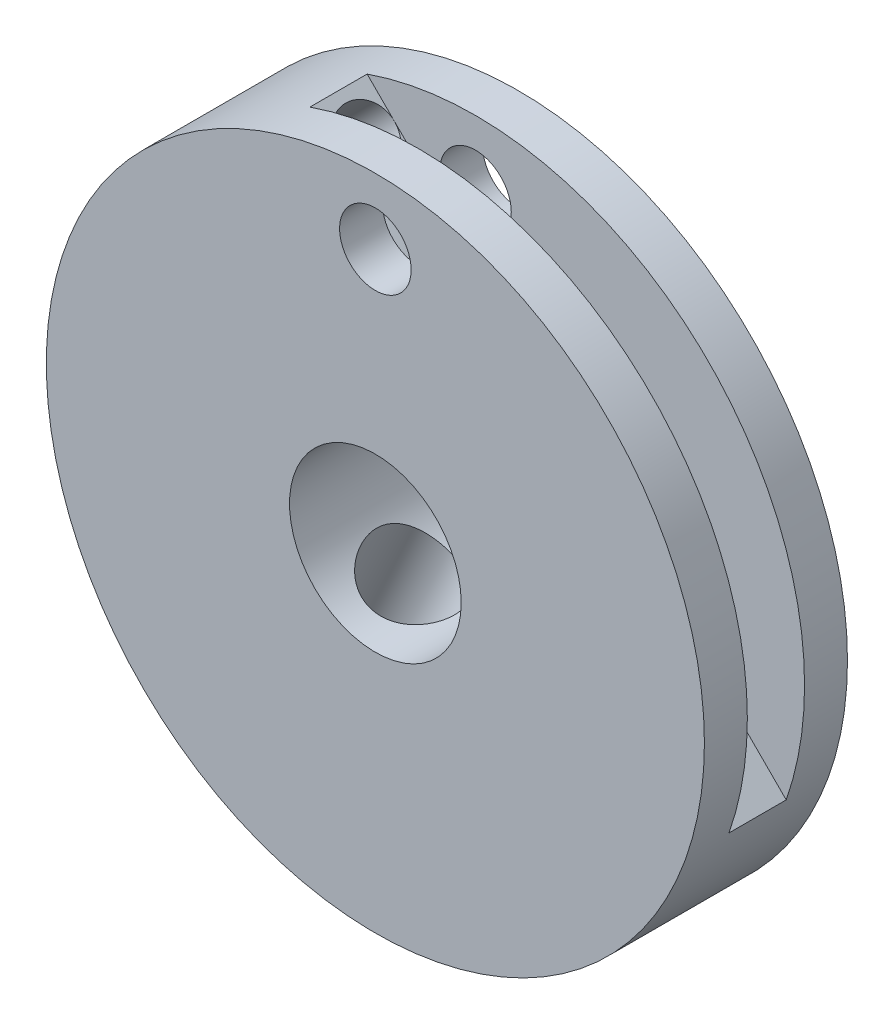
ISO-10303-21;
HEADER;
FILE_DESCRIPTION(('STEP AP214'),'2;1');
FILE_NAME('part.step','',(''),(''),'','','');
FILE_SCHEMA(('AUTOMOTIVE_DESIGN { 1 0 10303 214 1 1 1 1 }'));
ENDSEC;
DATA;
#1=APPLICATION_CONTEXT('core data for automotive mechanical design processes');
#2=APPLICATION_PROTOCOL_DEFINITION('international standard','automotive_design',2000,#1);
#3=PRODUCT_CONTEXT('',#1,'mechanical');
#4=PRODUCT('Part','Part','',(#3));
#5=PRODUCT_RELATED_PRODUCT_CATEGORY('part','',(#4));
#6=PRODUCT_DEFINITION_FORMATION('','',#4);
#7=PRODUCT_DEFINITION_CONTEXT('part definition',#1,'design');
#8=PRODUCT_DEFINITION('design','',#6,#7);
#9=PRODUCT_DEFINITION_SHAPE('','',#8);
#10=(LENGTH_UNIT() NAMED_UNIT(*) SI_UNIT(.MILLI.,.METRE.));
#11=(NAMED_UNIT(*) PLANE_ANGLE_UNIT() SI_UNIT($,.RADIAN.));
#12=(NAMED_UNIT(*) SI_UNIT($,.STERADIAN.) SOLID_ANGLE_UNIT());
#13=UNCERTAINTY_MEASURE_WITH_UNIT(LENGTH_MEASURE(1.E-05),#10,'distance_accuracy_value','');
#14=(GEOMETRIC_REPRESENTATION_CONTEXT(3) GLOBAL_UNCERTAINTY_ASSIGNED_CONTEXT((#13)) GLOBAL_UNIT_ASSIGNED_CONTEXT((#10,
#11,#12)) REPRESENTATION_CONTEXT('',''));
#15=CARTESIAN_POINT('',(0.,0.,0.));
#16=DIRECTION('',(0.,0.,1.));
#17=DIRECTION('',(1.,0.,0.));
#18=AXIS2_PLACEMENT_3D('',#15,#16,#17);
#19=CARTESIAN_POINT('',(0.,0.,5.));
#20=DIRECTION('',(0.,0.,-1.));
#21=DIRECTION('',(-1.,0.,0.));
#22=AXIS2_PLACEMENT_3D('',#19,#20,#21);
#23=CYLINDRICAL_SURFACE('',#22,11.5);
#24=CARTESIAN_POINT('',(-6.17805124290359,-9.69957127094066,2.5));
#25=CARTESIAN_POINT('',(-6.17804855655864,-9.69957390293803,2.58387025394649));
#26=CARTESIAN_POINT('',(-6.17204987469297,-9.70340186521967,2.66779217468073));
#27=CARTESIAN_POINT('',(-6.14818306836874,-9.71854088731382,2.83329827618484));
#28=CARTESIAN_POINT('',(-6.13030270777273,-9.72985966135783,2.91487995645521));
#29=CARTESIAN_POINT('',(-6.08311310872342,-9.75943160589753,3.07328548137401));
#30=CARTESIAN_POINT('',(-6.05381183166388,-9.77767994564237,3.15011259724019));
#31=CARTESIAN_POINT('',(-5.98448196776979,-9.82026592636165,3.29691225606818));
#32=CARTESIAN_POINT('',(-5.94445514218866,-9.8446025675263,3.36688592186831));
#33=CARTESIAN_POINT('',(-5.85436733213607,-9.89844147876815,3.49843161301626));
#34=CARTESIAN_POINT('',(-5.80425300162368,-9.92797110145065,3.55995591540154));
#35=CARTESIAN_POINT('',(-5.6953223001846,-9.99085837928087,3.67244392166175));
#36=CARTESIAN_POINT('',(-5.63650548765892,-10.024216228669,3.72340708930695));
#37=CARTESIAN_POINT('',(-5.51138466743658,-10.0935506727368,3.81349844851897));
#38=CARTESIAN_POINT('',(-5.4450544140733,-10.1295362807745,3.85258328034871));
#39=CARTESIAN_POINT('',(-5.30678786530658,-10.2026521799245,3.91753066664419));
#40=CARTESIAN_POINT('',(-5.23485179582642,-10.2397824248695,3.94339375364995));
#41=CARTESIAN_POINT('',(-5.08773627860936,-10.3136643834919,3.9810204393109));
#42=CARTESIAN_POINT('',(-5.01257764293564,-10.3504170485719,3.99286352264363));
#43=CARTESIAN_POINT('',(-4.86073922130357,-10.4225849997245,4.00236044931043));
#44=CARTESIAN_POINT('',(-4.78405950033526,-10.4580003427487,4.00001489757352));
#45=CARTESIAN_POINT('',(-4.63186026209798,-10.5262903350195,3.98126463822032));
#46=CARTESIAN_POINT('',(-4.55633652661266,-10.5591791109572,3.96494541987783));
#47=CARTESIAN_POINT('',(-4.40817900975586,-10.6218846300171,3.9188448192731));
#48=CARTESIAN_POINT('',(-4.33554528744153,-10.651701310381,3.88906316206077));
#49=CARTESIAN_POINT('',(-4.19511315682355,-10.7077899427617,3.81679285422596));
#50=CARTESIAN_POINT('',(-4.12732946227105,-10.7340513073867,3.77426741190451));
#51=CARTESIAN_POINT('',(-3.99886838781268,-10.7825680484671,3.67774345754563));
#52=CARTESIAN_POINT('',(-3.93819136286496,-10.8048232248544,3.62374437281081));
#53=CARTESIAN_POINT('',(-3.8253832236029,-10.8452786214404,3.50532766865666));
#54=CARTESIAN_POINT('',(-3.77331905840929,-10.863447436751,3.4408355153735));
#55=CARTESIAN_POINT('',(-3.67995017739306,-10.8954306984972,3.3035188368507));
#56=CARTESIAN_POINT('',(-3.63864550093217,-10.909245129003,3.23069428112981));
#57=CARTESIAN_POINT('',(-3.5681402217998,-10.9325093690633,3.07871187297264));
#58=CARTESIAN_POINT('',(-3.53894553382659,-10.9419570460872,2.99955094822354));
#59=CARTESIAN_POINT('',(-3.49368995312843,-10.9564912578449,2.83717865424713));
#60=CARTESIAN_POINT('',(-3.47762836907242,-10.9615780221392,2.75396749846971));
#61=CARTESIAN_POINT('',(-3.4592689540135,-10.9673858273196,2.58651088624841));
#62=CARTESIAN_POINT('',(-3.45687094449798,-10.9681386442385,2.50227750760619));
#63=CARTESIAN_POINT('',(-3.46565396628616,-10.9653665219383,2.33459452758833));
#64=CARTESIAN_POINT('',(-3.47683468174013,-10.9618416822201,2.25114490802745));
#65=CARTESIAN_POINT('',(-3.512318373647,-10.9505233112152,2.08771272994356));
#66=CARTESIAN_POINT('',(-3.53657271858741,-10.9427455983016,2.00771850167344));
#67=CARTESIAN_POINT('',(-3.59735154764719,-10.9229152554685,1.85310218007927));
#68=CARTESIAN_POINT('',(-3.63387649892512,-10.9108624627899,1.77848029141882));
#69=CARTESIAN_POINT('',(-3.71824381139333,-10.8824008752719,1.63625623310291));
#70=CARTESIAN_POINT('',(-3.76614991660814,-10.8659674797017,1.5686968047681));
#71=CARTESIAN_POINT('',(-3.87163585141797,-10.8288297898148,1.4429521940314));
#72=CARTESIAN_POINT('',(-3.92921609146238,-10.8081253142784,1.3847674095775));
#73=CARTESIAN_POINT('',(-4.05264834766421,-10.7624527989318,1.27905597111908));
#74=CARTESIAN_POINT('',(-4.11854962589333,-10.737459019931,1.23159792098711));
#75=CARTESIAN_POINT('',(-4.25630829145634,-10.6835996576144,1.14916246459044));
#76=CARTESIAN_POINT('',(-4.32816554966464,-10.6547341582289,1.11418478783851));
#77=CARTESIAN_POINT('',(-4.47543778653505,-10.5937144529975,1.05781551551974));
#78=CARTESIAN_POINT('',(-4.55084181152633,-10.5615700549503,1.03638470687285));
#79=CARTESIAN_POINT('',(-4.70314484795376,-10.4946340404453,1.00759007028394));
#80=CARTESIAN_POINT('',(-4.78004378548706,-10.4598425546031,1.000225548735));
#81=CARTESIAN_POINT('',(-4.93251284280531,-10.3888083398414,0.999786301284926));
#82=CARTESIAN_POINT('',(-5.00808858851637,-10.352578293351,1.00660595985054));
#83=CARTESIAN_POINT('',(-5.15637284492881,-10.2795259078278,1.03411725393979));
#84=CARTESIAN_POINT('',(-5.22908135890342,-10.2427035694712,1.05480887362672));
#85=CARTESIAN_POINT('',(-5.36964513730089,-10.1697190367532,1.10944266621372));
#86=CARTESIAN_POINT('',(-5.43750241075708,-10.1335565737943,1.14337931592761));
#87=CARTESIAN_POINT('',(-5.56666056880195,-10.0631856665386,1.22352886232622));
#88=CARTESIAN_POINT('',(-5.62796134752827,-10.0289772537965,1.26974195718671));
#89=CARTESIAN_POINT('',(-5.74291476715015,-9.96360078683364,1.37352165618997));
#90=CARTESIAN_POINT('',(-5.79650984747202,-9.93245611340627,1.4311667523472));
#91=CARTESIAN_POINT('',(-5.89425023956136,-9.87476803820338,1.55601030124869));
#92=CARTESIAN_POINT('',(-5.938393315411,-9.84822572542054,1.62321100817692));
#93=CARTESIAN_POINT('',(-6.01632898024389,-9.80081025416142,1.76558435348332));
#94=CARTESIAN_POINT('',(-6.05007727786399,-9.77996139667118,1.84078931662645));
#95=CARTESIAN_POINT('',(-6.10613017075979,-9.74506409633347,1.99676783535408));
#96=CARTESIAN_POINT('',(-6.12844709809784,-9.73100832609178,2.07753528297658));
#97=CARTESIAN_POINT('',(-6.15584012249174,-9.71369108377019,2.21559179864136));
#98=CARTESIAN_POINT('',(-6.16415910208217,-9.70840802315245,2.27201341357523));
#99=CARTESIAN_POINT('',(-6.17526555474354,-9.7013472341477,2.38561534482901));
#100=CARTESIAN_POINT('',(-6.17805307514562,-9.69956947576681,2.44279565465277));
#101=CARTESIAN_POINT('',(-6.17805124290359,-9.69957127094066,2.5));
#102=B_SPLINE_CURVE_WITH_KNOTS('',3,(#24,#25,#26,#27,#28,#29,#30,#31,#32,#33,#34,#35,#36,#37,
#38,#39,#40,#41,#42,#43,#44,#45,#46,#47,#48,#49,#50,#51,#52,#53,#54,#55,#56,#57,#58,#59,#60,#61,
#62,#63,#64,#65,#66,#67,#68,#69,#70,#71,#72,#73,#74,#75,#76,#77,#78,#79,#80,#81,#82,#83,#84,#85,
#86,#87,#88,#89,#90,#91,#92,#93,#94,#95,#96,#97,#98,#99,#100,#101),.UNSPECIFIED.,.T.,.F.,(4,2,2,
2,2,2,2,2,2,2,2,2,2,2,2,2,2,2,2,2,2,2,2,2,2,2,2,2,2,2,2,2,2,2,2,2,2,2,4),(0.,0.251401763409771,
0.503062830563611,0.754548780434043,1.00599345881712,1.25880454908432,1.51162847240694,
1.76536449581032,2.01909029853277,2.27137063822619,2.52364022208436,2.77437738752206,
3.0251196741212,3.27659295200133,3.52807878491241,3.7814359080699,4.03479395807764,
4.28827560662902,4.54174391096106,4.79335142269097,5.04495308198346,5.29562522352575,
5.54630690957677,5.79842717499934,6.05055813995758,6.30425867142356,6.55795370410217,
6.8109109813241,7.06385578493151,7.31492390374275,7.56599173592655,7.81695498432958,
8.06792228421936,8.32067641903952,8.57349027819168,8.82736691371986,9.08096908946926,
9.25244104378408,9.42391153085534),.UNSPECIFIED.);
#103=CARTESIAN_POINT('',(-6.17805124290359,-9.69957127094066,2.5));
#104=VERTEX_POINT('',#103);
#105=EDGE_CURVE('E411',#104,#104,#102,.T.);
#106=ORIENTED_EDGE('',*,*,#105,.T.);
#107=EDGE_LOOP('',(#106));
#108=FACE_BOUND('',#107,.T.);
#109=CARTESIAN_POINT('',(0.,0.,1.5));
#110=DIRECTION('',(0.,0.,1.));
#111=DIRECTION('',(1.,0.,0.));
#112=AXIS2_PLACEMENT_3D('',#109,#110,#111);
#113=CIRCLE('',#112,11.5);
#114=CARTESIAN_POINT('',(10.8584431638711,-3.78737535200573,1.5));
#115=VERTEX_POINT('',#114);
#116=CARTESIAN_POINT('',(-3.78737535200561,10.8584431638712,1.5));
#117=VERTEX_POINT('',#116);
#118=EDGE_CURVE('E419',#115,#117,#113,.T.);
#119=ORIENTED_EDGE('',*,*,#118,.F.);
#120=DIRECTION('',(0.,0.,1.));
#121=VECTOR('',#120,1.);
#122=CARTESIAN_POINT('',(10.8584431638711,-3.78737535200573,1.5));
#123=LINE('',#122,#121);
#124=CARTESIAN_POINT('',(10.8584431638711,-3.78737535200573,3.5));
#125=VERTEX_POINT('',#124);
#126=EDGE_CURVE('E416',#115,#125,#123,.T.);
#127=ORIENTED_EDGE('',*,*,#126,.T.);
#128=CARTESIAN_POINT('',(0.,0.,3.5));
#129=DIRECTION('',(0.,0.,1.));
#130=DIRECTION('',(1.,0.,0.));
#131=AXIS2_PLACEMENT_3D('',#128,#129,#130);
#132=CIRCLE('',#131,11.5);
#133=CARTESIAN_POINT('',(-3.78737535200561,10.8584431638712,3.5));
#134=VERTEX_POINT('',#133);
#135=EDGE_CURVE('E508',#125,#134,#132,.T.);
#136=ORIENTED_EDGE('',*,*,#135,.T.);
#137=DIRECTION('',(0.,0.,1.));
#138=VECTOR('',#137,1.);
#139=CARTESIAN_POINT('',(-3.78737535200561,10.8584431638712,1.5));
#140=LINE('',#139,#138);
#141=EDGE_CURVE('E422',#117,#134,#140,.T.);
#142=ORIENTED_EDGE('',*,*,#141,.F.);
#143=EDGE_LOOP('',(#119,#127,#136,#142));
#144=FACE_BOUND('',#143,.T.);
#145=CARTESIAN_POINT('',(0.,0.,5.));
#146=DIRECTION('',(0.,0.,1.));
#147=DIRECTION('',(1.,0.,0.));
#148=AXIS2_PLACEMENT_3D('',#145,#146,#147);
#149=CIRCLE('',#148,11.5);
#150=CARTESIAN_POINT('',(11.5,0.,5.));
#151=VERTEX_POINT('',#150);
#152=EDGE_CURVE('E445',#151,#151,#149,.T.);
#153=ORIENTED_EDGE('',*,*,#152,.F.);
#154=EDGE_LOOP('',(#153));
#155=FACE_BOUND('',#154,.T.);
#156=CARTESIAN_POINT('',(0.,0.,0.));
#157=DIRECTION('',(0.,0.,1.));
#158=DIRECTION('',(1.,0.,0.));
#159=AXIS2_PLACEMENT_3D('',#156,#157,#158);
#160=CIRCLE('',#159,11.5);
#161=CARTESIAN_POINT('',(11.5,0.,0.));
#162=VERTEX_POINT('',#161);
#163=EDGE_CURVE('E442',#162,#162,#160,.T.);
#164=ORIENTED_EDGE('',*,*,#163,.T.);
#165=EDGE_LOOP('',(#164));
#166=FACE_BOUND('',#165,.T.);
#167=CARTESIAN_POINT('',(-11.5,0.,4.20500029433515));
#168=CARTESIAN_POINT('',(-11.4999968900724,0.152109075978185,4.25977367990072));
#169=CARTESIAN_POINT('',(-11.4969477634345,0.308613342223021,4.30224728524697));
#170=CARTESIAN_POINT('',(-11.4840752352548,0.625507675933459,4.36610531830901));
#171=CARTESIAN_POINT('',(-11.474246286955,0.785900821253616,4.38747244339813));
#172=CARTESIAN_POINT('',(-11.4499948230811,1.0795570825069,4.41017789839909));
#173=CARTESIAN_POINT('',(-11.4366609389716,1.21271408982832,4.41434135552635));
#174=CARTESIAN_POINT('',(-11.4053551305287,1.47843842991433,4.41197536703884));
#175=CARTESIAN_POINT('',(-11.3873805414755,1.61100537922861,4.40543976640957));
#176=CARTESIAN_POINT('',(-11.3469068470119,1.87499191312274,4.38289820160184));
#177=CARTESIAN_POINT('',(-11.3243950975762,2.00640719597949,4.3668655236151));
#178=CARTESIAN_POINT('',(-11.2751056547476,2.26706513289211,4.32631223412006));
#179=CARTESIAN_POINT('',(-11.2483287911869,2.39630820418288,4.3017932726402));
#180=CARTESIAN_POINT('',(-11.1895735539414,2.65745948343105,4.24382452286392));
#181=CARTESIAN_POINT('',(-11.157425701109,2.78925642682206,4.21004695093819));
#182=CARTESIAN_POINT('',(-11.0891200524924,3.04951074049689,4.13459594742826));
#183=CARTESIAN_POINT('',(-11.0529620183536,3.17796791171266,4.09292204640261));
#184=CARTESIAN_POINT('',(-10.9771715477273,3.43060343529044,4.00197501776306));
#185=CARTESIAN_POINT('',(-10.9375507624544,3.55479431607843,3.95272698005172));
#186=CARTESIAN_POINT('',(-10.855280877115,3.79860552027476,3.84623885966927));
#187=CARTESIAN_POINT('',(-10.8126334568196,3.91822832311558,3.78900319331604));
#188=CARTESIAN_POINT('',(-10.7360035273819,4.12274225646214,3.68083379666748));
#189=CARTESIAN_POINT('',(-10.7025093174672,4.20886152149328,3.63188251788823));
#190=CARTESIAN_POINT('',(-10.6347399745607,4.37727804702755,3.52779598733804));
#191=CARTESIAN_POINT('',(-10.6004632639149,4.45956633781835,3.47264716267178));
#192=CARTESIAN_POINT('',(-10.531806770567,4.61937428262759,3.3540806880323));
#193=CARTESIAN_POINT('',(-10.4974286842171,4.69684623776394,3.29059529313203));
#194=CARTESIAN_POINT('',(-10.4476439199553,4.80607457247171,3.18735501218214));
#195=CARTESIAN_POINT('',(-10.4313716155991,4.84126805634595,3.15167209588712));
#196=CARTESIAN_POINT('',(-10.3998924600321,4.90852358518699,3.0770639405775));
#197=CARTESIAN_POINT('',(-10.3846842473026,4.94058965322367,3.03814298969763));
#198=CARTESIAN_POINT('',(-10.3586544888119,4.9948989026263,2.96384146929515));
#199=CARTESIAN_POINT('',(-10.3475380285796,5.0178681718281,2.92910300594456));
#200=CARTESIAN_POINT('',(-10.3271083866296,5.05978014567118,2.85670527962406));
#201=CARTESIAN_POINT('',(-10.3177957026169,5.0787217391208,2.81904521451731));
#202=CARTESIAN_POINT('',(-10.3016943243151,5.11130432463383,2.7402289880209));
#203=CARTESIAN_POINT('',(-10.2949444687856,5.12486388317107,2.69902980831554));
#204=CARTESIAN_POINT('',(-10.2851693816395,5.1444551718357,2.61448143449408));
#205=CARTESIAN_POINT('',(-10.2821333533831,5.15050872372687,2.57113885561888));
#206=CARTESIAN_POINT('',(-10.2804539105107,5.15385955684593,2.48929814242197));
#207=CARTESIAN_POINT('',(-10.2813231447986,5.15212830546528,2.45084886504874));
#208=CARTESIAN_POINT('',(-10.2862202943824,5.14234384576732,2.37495517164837));
#209=CARTESIAN_POINT('',(-10.2902525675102,5.13428191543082,2.33751221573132));
#210=CARTESIAN_POINT('',(-10.3021941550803,5.11028462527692,2.25594591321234));
#211=CARTESIAN_POINT('',(-10.3107977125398,5.09293223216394,2.21235304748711));
#212=CARTESIAN_POINT('',(-10.3307709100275,5.05229545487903,2.12873602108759));
#213=CARTESIAN_POINT('',(-10.3421468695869,5.02899751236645,2.08872030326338));
#214=CARTESIAN_POINT('',(-10.3768641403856,4.95714751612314,1.98006628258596));
#215=CARTESIAN_POINT('',(-10.4022753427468,4.90373194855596,1.91537139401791));
#216=CARTESIAN_POINT('',(-10.4554972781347,4.78922021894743,1.79436326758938));
#217=CARTESIAN_POINT('',(-10.48331620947,4.7280974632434,1.73808060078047));
#218=CARTESIAN_POINT('',(-10.5317277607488,4.61900420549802,1.6469640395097));
#219=CARTESIAN_POINT('',(-10.552129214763,4.572227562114,1.61057782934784));
#220=CARTESIAN_POINT('',(-10.593014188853,4.47669007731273,1.54054699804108));
#221=CARTESIAN_POINT('',(-10.6134977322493,4.42792862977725,1.50690322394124));
#222=CARTESIAN_POINT('',(-10.6747684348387,4.27911362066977,1.40939139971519));
#223=CARTESIAN_POINT('',(-10.7153204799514,4.17665288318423,1.34904181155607));
#224=CARTESIAN_POINT('',(-10.7948308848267,3.96665042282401,1.23564827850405));
#225=CARTESIAN_POINT('',(-10.8337821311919,3.85908981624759,1.18263488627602));
#226=CARTESIAN_POINT('',(-10.9092775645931,3.64020048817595,1.08334319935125));
#227=CARTESIAN_POINT('',(-10.9458234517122,3.52887451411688,1.03706011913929));
#228=CARTESIAN_POINT('',(-11.027591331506,3.26601559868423,0.936718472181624));
#229=CARTESIAN_POINT('',(-11.0717474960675,3.11322846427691,0.885059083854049));
#230=CARTESIAN_POINT('',(-11.1543986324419,2.8027184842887,0.792935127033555));
#231=CARTESIAN_POINT('',(-11.192890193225,2.64499273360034,0.752477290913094));
#232=CARTESIAN_POINT('',(-11.2634679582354,2.32612173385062,0.683812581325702));
#233=CARTESIAN_POINT('',(-11.2955782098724,2.16499195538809,0.655559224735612));
#234=CARTESIAN_POINT('',(-11.3530694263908,1.83985014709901,0.612616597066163));
#235=CARTESIAN_POINT('',(-11.3784556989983,1.67584050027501,0.597916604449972));
#236=CARTESIAN_POINT('',(-11.425906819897,1.31779492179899,0.582991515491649));
#237=CARTESIAN_POINT('',(-11.4466525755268,1.1234394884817,0.585685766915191));
#238=CARTESIAN_POINT('',(-11.4780681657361,0.735909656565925,0.617203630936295));
#239=CARTESIAN_POINT('',(-11.4887475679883,0.542734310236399,0.646002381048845));
#240=CARTESIAN_POINT('',(-11.4990489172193,0.207676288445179,0.725005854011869));
#241=CARTESIAN_POINT('',(-11.500667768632,0.0643315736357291,0.768657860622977));
#242=CARTESIAN_POINT('',(-11.4988454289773,-0.213974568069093,0.877517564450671));
#243=CARTESIAN_POINT('',(-11.4954117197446,-0.348948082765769,0.942693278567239));
#244=CARTESIAN_POINT('',(-11.4860999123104,-0.573566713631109,1.07816800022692));
#245=CARTESIAN_POINT('',(-11.4810137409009,-0.666280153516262,1.14341653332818));
#246=CARTESIAN_POINT('',(-11.4696115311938,-0.839973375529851,1.28797802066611));
#247=CARTESIAN_POINT('',(-11.463296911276,-0.920966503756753,1.36727474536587));
#248=CARTESIAN_POINT('',(-11.4516215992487,-1.05555478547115,1.52552473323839));
#249=CARTESIAN_POINT('',(-11.4462697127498,-1.11145988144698,1.60250812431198));
#250=CARTESIAN_POINT('',(-11.4363009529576,-1.20973802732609,1.76477505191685));
#251=CARTESIAN_POINT('',(-11.4316838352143,-1.25211558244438,1.85005581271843));
#252=CARTESIAN_POINT('',(-11.4238963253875,-1.32129766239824,2.02734833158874));
#253=CARTESIAN_POINT('',(-11.4207335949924,-1.34801991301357,2.11939283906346));
#254=CARTESIAN_POINT('',(-11.4164395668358,-1.38392480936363,2.30689546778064));
#255=CARTESIAN_POINT('',(-11.415307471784,-1.39311433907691,2.40235223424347));
#256=CARTESIAN_POINT('',(-11.4152733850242,-1.39338526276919,2.58430115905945));
#257=CARTESIAN_POINT('',(-11.416172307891,-1.38608322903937,2.67079493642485));
#258=CARTESIAN_POINT('',(-11.4196631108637,-1.35702099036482,2.84125884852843));
#259=CARTESIAN_POINT('',(-11.4222547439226,-1.33526289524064,2.92522934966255));
#260=CARTESIAN_POINT('',(-11.428736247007,-1.27858693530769,3.08781516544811));
#261=CARTESIAN_POINT('',(-11.4326164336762,-1.24376698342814,3.16646530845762));
#262=CARTESIAN_POINT('',(-11.4411645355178,-1.16250486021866,3.31743029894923));
#263=CARTESIAN_POINT('',(-11.4458326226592,-1.11606015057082,3.38974375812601));
#264=CARTESIAN_POINT('',(-11.4558190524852,-1.00864458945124,3.53319718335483));
#265=CARTESIAN_POINT('',(-11.4611578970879,-0.94673601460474,3.60363046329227));
#266=CARTESIAN_POINT('',(-11.4713823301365,-0.813547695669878,3.73498618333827));
#267=CARTESIAN_POINT('',(-11.4762676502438,-0.742262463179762,3.79590300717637));
#268=CARTESIAN_POINT('',(-11.4864843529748,-0.566427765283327,3.92763713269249));
#269=CARTESIAN_POINT('',(-11.4913814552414,-0.45892355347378,3.99454586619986));
#270=CARTESIAN_POINT('',(-11.4981425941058,-0.235183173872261,4.11182508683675));
#271=CARTESIAN_POINT('',(-11.5000024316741,-0.118935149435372,4.16217260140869));
#272=CARTESIAN_POINT('',(-11.5,0.,4.20500029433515));
#273=B_SPLINE_CURVE_WITH_KNOTS('',3,(#167,#168,#169,#170,#171,#172,#173,#174,#175,#176,#177,
#178,#179,#180,#181,#182,#183,#184,#185,#186,#187,#188,#189,#190,#191,#192,#193,#194,#195,#196,
#197,#198,#199,#200,#201,#202,#203,#204,#205,#206,#207,#208,#209,#210,#211,#212,#213,#214,#215,
#216,#217,#218,#219,#220,#221,#222,#223,#224,#225,#226,#227,#228,#229,#230,#231,#232,#233,#234,
#235,#236,#237,#238,#239,#240,#241,#242,#243,#244,#245,#246,#247,#248,#249,#250,#251,#252,#253,
#254,#255,#256,#257,#258,#259,#260,#261,#262,#263,#264,#265,#266,#267,#268,#269,#270,#271,#272),
.UNSPECIFIED.,.T.,.F.,(4,2,2,2,2,2,2,2,2,2,2,2,2,2,2,2,2,2,2,2,2,2,2,2,2,2,2,2,2,2,2,2,2,2,2,2,
2,2,2,2,2,2,2,2,2,2,2,2,2,2,2,2,4),(0.,0.484621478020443,0.969639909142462,1.37076387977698,
1.77211869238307,2.17460785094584,2.57701879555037,2.99609374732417,3.41519362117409,
3.83293396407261,4.25044424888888,4.56393873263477,4.8781336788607,5.19506127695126,
5.35300129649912,5.51073538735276,5.63980290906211,5.7689059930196,5.89989413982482,
6.03050057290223,6.14529308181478,6.26024402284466,6.40254807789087,6.5451795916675,
6.80669645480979,7.06914172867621,7.25706250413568,7.44504110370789,7.82149902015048,
8.19948038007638,8.57719165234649,9.07829284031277,9.57969455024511,10.0791693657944,
10.5782487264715,11.1630363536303,11.7472676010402,12.1953449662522,12.642759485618,
12.9819767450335,13.3208046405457,13.6054901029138,13.8900806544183,14.1761537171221,
14.4621144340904,14.7212715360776,14.980390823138,15.2376053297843,15.4948760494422,
15.7755776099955,16.0564442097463,16.4348504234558,16.8137793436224),.UNSPECIFIED.);
#274=CARTESIAN_POINT('',(-10.3177499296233,5.078782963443,2.1834871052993));
#275=VERTEX_POINT('',#274);
#276=CARTESIAN_POINT('',(-10.3177499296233,5.078782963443,2.8165128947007));
#277=VERTEX_POINT('',#276);
#278=EDGE_CURVE('E11',#275,#277,#273,.T.);
#279=ORIENTED_EDGE('',*,*,#278,.F.);
#280=DIRECTION('',(0.,0.,-1.));
#281=VECTOR('',#280,1.);
#282=CARTESIAN_POINT('',(-10.3177499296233,5.07878296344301,5.));
#283=LINE('',#282,#281);
#284=EDGE_CURVE('E365',#277,#275,#283,.T.);
#285=ORIENTED_EDGE('',*,*,#284,.F.);
#286=EDGE_LOOP('',(#279,#285));
#287=FACE_BOUND('',#286,.T.);
#288=ADVANCED_FACE('F352',(#108,#144,#155,#166,#287),#23,.T.);
#289=CARTESIAN_POINT('',(-3.78737535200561,10.8584431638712,1.5));
#290=DIRECTION('',(-0.707106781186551,-0.707106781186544,0.));
#291=DIRECTION('',(0.707106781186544,-0.707106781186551,0.));
#292=AXIS2_PLACEMENT_3D('',#289,#290,#291);
#293=PLANE('',#292);
#294=CARTESIAN_POINT('',(-2.82842712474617,9.89949493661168,2.5));
#295=DIRECTION('',(0.707106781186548,0.707106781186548,0.));
#296=DIRECTION('',(-0.707106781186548,0.707106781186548,0.));
#297=AXIS2_PLACEMENT_3D('',#294,#295,#296);
#298=CIRCLE('',#297,1.);
#299=CARTESIAN_POINT('',(-2.82842712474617,9.89949493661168,1.5));
#300=VERTEX_POINT('',#299);
#301=CARTESIAN_POINT('',(-2.82842712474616,9.8994949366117,3.5));
#302=VERTEX_POINT('',#301);
#303=EDGE_CURVE('E377',#300,#302,#298,.T.);
#304=ORIENTED_EDGE('',*,*,#303,.F.);
#305=DIRECTION('',(0.707106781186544,-0.707106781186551,0.));
#306=VECTOR('',#305,1.);
#307=CARTESIAN_POINT('',(-3.78737535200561,10.8584431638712,1.5));
#308=LINE('',#307,#306);
#309=EDGE_CURVE('E408',#117,#300,#308,.T.);
#310=ORIENTED_EDGE('',*,*,#309,.F.);
#311=ORIENTED_EDGE('',*,*,#141,.T.);
#312=DIRECTION('',(0.707106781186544,-0.707106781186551,0.));
#313=VECTOR('',#312,1.);
#314=CARTESIAN_POINT('',(-3.78737535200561,10.8584431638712,3.5));
#315=LINE('',#314,#313);
#316=EDGE_CURVE('E410',#134,#302,#315,.T.);
#317=ORIENTED_EDGE('',*,*,#316,.T.);
#318=EDGE_LOOP('',(#304,#310,#311,#317));
#319=FACE_BOUND('',#318,.T.);
#320=ADVANCED_FACE('F405',(#319),#293,.F.);
#321=EDGE_CURVE('E394',#302,#300,#298,.T.);
#322=ORIENTED_EDGE('',*,*,#321,.F.);
#323=EDGE_CURVE('E512',#302,#125,#315,.T.);
#324=ORIENTED_EDGE('',*,*,#323,.T.);
#325=ORIENTED_EDGE('',*,*,#126,.F.);
#326=EDGE_CURVE('E413',#300,#115,#308,.T.);
#327=ORIENTED_EDGE('',*,*,#326,.F.);
#328=EDGE_LOOP('',(#322,#324,#325,#327));
#329=FACE_BOUND('',#328,.T.);
#330=ADVANCED_FACE('F414',(#329),#293,.F.);
#331=CARTESIAN_POINT('',(0.,9.2,5.));
#332=DIRECTION('',(0.,0.,-1.));
#333=DIRECTION('',(-1.,0.,0.));
#334=AXIS2_PLACEMENT_3D('',#331,#332,#333);
#335=CYLINDRICAL_SURFACE('',#334,1.25);
#336=CARTESIAN_POINT('',(0.,9.2,0.));
#337=DIRECTION('',(0.,0.,1.));
#338=DIRECTION('',(1.,0.,0.));
#339=AXIS2_PLACEMENT_3D('',#336,#337,#338);
#340=CIRCLE('',#339,1.25);
#341=CARTESIAN_POINT('',(1.25,9.2,0.));
#342=VERTEX_POINT('',#341);
#343=EDGE_CURVE('E429',#342,#342,#340,.T.);
#344=ORIENTED_EDGE('',*,*,#343,.F.);
#345=EDGE_LOOP('',(#344));
#346=FACE_BOUND('',#345,.T.);
#347=CARTESIAN_POINT('',(0.,9.2,1.5));
#348=DIRECTION('',(0.,0.,1.));
#349=DIRECTION('',(1.,0.,0.));
#350=AXIS2_PLACEMENT_3D('',#347,#348,#349);
#351=CIRCLE('',#350,1.25);
#352=CARTESIAN_POINT('',(1.25,9.2,1.5));
#353=VERTEX_POINT('',#352);
#354=EDGE_CURVE('E433',#353,#353,#351,.T.);
#355=ORIENTED_EDGE('',*,*,#354,.T.);
#356=EDGE_LOOP('',(#355));
#357=FACE_BOUND('',#356,.T.);
#358=ADVANCED_FACE('F476',(#346,#357),#335,.F.);
#359=CARTESIAN_POINT('',(0.,0.,5.));
#360=DIRECTION('',(0.,0.,1.));
#361=DIRECTION('',(1.,0.,0.));
#362=AXIS2_PLACEMENT_3D('',#359,#360,#361);
#363=PLANE('',#362);
#364=CARTESIAN_POINT('',(0.,0.,5.));
#365=DIRECTION('',(0.,0.,1.));
#366=DIRECTION('',(1.,0.,0.));
#367=AXIS2_PLACEMENT_3D('',#364,#365,#366);
#368=CIRCLE('',#367,3.);
#369=CARTESIAN_POINT('',(3.,0.,5.));
#370=VERTEX_POINT('',#369);
#371=EDGE_CURVE('E439',#370,#370,#368,.T.);
#372=ORIENTED_EDGE('',*,*,#371,.F.);
#373=EDGE_LOOP('',(#372));
#374=FACE_BOUND('',#373,.T.);
#375=ORIENTED_EDGE('',*,*,#152,.T.);
#376=EDGE_LOOP('',(#375));
#377=FACE_BOUND('',#376,.T.);
#378=CARTESIAN_POINT('',(0.,9.2,5.));
#379=DIRECTION('',(0.,0.,1.));
#380=DIRECTION('',(1.,0.,0.));
#381=AXIS2_PLACEMENT_3D('',#378,#379,#380);
#382=CIRCLE('',#381,1.25);
#383=CARTESIAN_POINT('',(1.25,9.2,5.));
#384=VERTEX_POINT('',#383);
#385=EDGE_CURVE('E432',#384,#384,#382,.T.);
#386=ORIENTED_EDGE('',*,*,#385,.F.);
#387=EDGE_LOOP('',(#386));
#388=FACE_BOUND('',#387,.T.);
#389=ADVANCED_FACE('F483',(#374,#377,#388),#363,.T.);
#390=CARTESIAN_POINT('',(0.,0.,0.));
#391=DIRECTION('',(0.,0.,1.));
#392=DIRECTION('',(1.,0.,0.));
#393=AXIS2_PLACEMENT_3D('',#390,#391,#392);
#394=PLANE('',#393);
#395=CARTESIAN_POINT('',(0.,0.,0.));
#396=DIRECTION('',(0.,0.,1.));
#397=DIRECTION('',(1.,0.,0.));
#398=AXIS2_PLACEMENT_3D('',#395,#396,#397);
#399=CIRCLE('',#398,3.);
#400=CARTESIAN_POINT('',(3.,0.,0.));
#401=VERTEX_POINT('',#400);
#402=EDGE_CURVE('E436',#401,#401,#399,.T.);
#403=ORIENTED_EDGE('',*,*,#402,.T.);
#404=EDGE_LOOP('',(#403));
#405=FACE_BOUND('',#404,.T.);
#406=ORIENTED_EDGE('',*,*,#163,.F.);
#407=EDGE_LOOP('',(#406));
#408=FACE_BOUND('',#407,.T.);
#409=ORIENTED_EDGE('',*,*,#343,.T.);
#410=EDGE_LOOP('',(#409));
#411=FACE_BOUND('',#410,.T.);
#412=ADVANCED_FACE('F480',(#405,#408,#411),#394,.F.);
#413=CARTESIAN_POINT('',(0.,0.,5.));
#414=DIRECTION('',(0.,0.,-1.));
#415=DIRECTION('',(-1.,0.,0.));
#416=AXIS2_PLACEMENT_3D('',#413,#414,#415);
#417=CYLINDRICAL_SURFACE('',#416,3.);
#418=CARTESIAN_POINT('',(-2.45745613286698,-1.72072930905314,2.5));
#419=CARTESIAN_POINT('',(-2.45745406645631,-1.72073778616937,2.57816171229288));
#420=CARTESIAN_POINT('',(-2.45339561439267,-1.72657374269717,2.65642211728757));
#421=CARTESIAN_POINT('',(-2.43722696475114,-1.74931617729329,2.81054089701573));
#422=CARTESIAN_POINT('',(-2.4250998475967,-1.76624591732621,2.88639387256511));
#423=CARTESIAN_POINT('',(-2.39305453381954,-1.80942023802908,3.03317749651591));
#424=CARTESIAN_POINT('',(-2.37317773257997,-1.83561525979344,3.10413197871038));
#425=CARTESIAN_POINT('',(-2.3257945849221,-1.89529068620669,3.24013630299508));
#426=CARTESIAN_POINT('',(-2.29828782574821,-1.92877148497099,3.30518582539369));
#427=CARTESIAN_POINT('',(-2.23313064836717,-2.00394531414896,3.43345859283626));
#428=CARTESIAN_POINT('',(-2.19483071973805,-2.04608791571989,3.49608870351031));
#429=CARTESIAN_POINT('',(-2.10940435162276,-2.13405089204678,3.61211258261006));
#430=CARTESIAN_POINT('',(-2.06227353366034,-2.17987308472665,3.66550174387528));
#431=CARTESIAN_POINT('',(-1.95585515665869,-2.27598402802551,3.76505072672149));
#432=CARTESIAN_POINT('',(-1.89596229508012,-2.32636565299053,3.8104806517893));
#433=CARTESIAN_POINT('',(-1.76696798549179,-2.42578562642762,3.88771127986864));
#434=CARTESIAN_POINT('',(-1.6978723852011,-2.47482480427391,3.91952058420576));
#435=CARTESIAN_POINT('',(-1.55718146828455,-2.56547899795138,3.96625699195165));
#436=CARTESIAN_POINT('',(-1.48611384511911,-2.60737399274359,3.9822242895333));
#437=CARTESIAN_POINT('',(-1.33937061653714,-2.68570049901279,4.00024917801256));
#438=CARTESIAN_POINT('',(-1.26369782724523,-2.72213530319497,4.00231518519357));
#439=CARTESIAN_POINT('',(-1.11703915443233,-2.78532703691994,3.99287998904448));
#440=CARTESIAN_POINT('',(-1.04621794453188,-2.81265003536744,3.98254297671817));
#441=CARTESIAN_POINT('',(-0.905021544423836,-2.86120795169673,3.95067873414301));
#442=CARTESIAN_POINT('',(-0.834646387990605,-2.88244241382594,3.92915066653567));
#443=CARTESIAN_POINT('',(-0.695393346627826,-2.91919352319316,3.87537615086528));
#444=CARTESIAN_POINT('',(-0.626549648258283,-2.93462699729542,3.8429855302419));
#445=CARTESIAN_POINT('',(-0.493176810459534,-2.95996481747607,3.76860487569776));
#446=CARTESIAN_POINT('',(-0.428649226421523,-2.9698671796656,3.72661140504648));
#447=CARTESIAN_POINT('',(-0.299655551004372,-2.98576934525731,3.62965697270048));
#448=CARTESIAN_POINT('',(-0.23577185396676,-2.99131176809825,3.57384545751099));
#449=CARTESIAN_POINT('',(-0.116941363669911,-2.99831204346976,3.45311541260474));
#450=CARTESIAN_POINT('',(-0.0620014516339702,-2.99976676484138,3.38818994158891));
#451=CARTESIAN_POINT('',(0.0400760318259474,-3.0001940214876,3.24602771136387));
#452=CARTESIAN_POINT('',(0.0864965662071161,-2.99900306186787,3.16827096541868));
#453=CARTESIAN_POINT('',(0.164313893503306,-2.99575248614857,3.0055934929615));
#454=CARTESIAN_POINT('',(0.195726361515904,-2.99369378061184,2.92068035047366));
#455=CARTESIAN_POINT('',(0.239350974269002,-2.99051124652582,2.75317823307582));
#456=CARTESIAN_POINT('',(0.252887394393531,-2.98932626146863,2.67093832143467));
#457=CARTESIAN_POINT('',(0.264081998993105,-2.9883608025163,2.50539798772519));
#458=CARTESIAN_POINT('',(0.261751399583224,-2.98857933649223,2.42209835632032));
#459=CARTESIAN_POINT('',(0.242573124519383,-2.99018823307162,2.26651912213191));
#460=CARTESIAN_POINT('',(0.227341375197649,-2.99144779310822,2.19403082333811));
#461=CARTESIAN_POINT('',(0.185459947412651,-2.99433495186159,2.05244832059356));
#462=CARTESIAN_POINT('',(0.158806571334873,-2.99596266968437,1.98335522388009));
#463=CARTESIAN_POINT('',(0.0939653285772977,-2.9987106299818,1.84688300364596));
#464=CARTESIAN_POINT('',(0.0553004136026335,-2.99980387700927,1.77973147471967));
#465=CARTESIAN_POINT('',(-0.0314319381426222,-3.00014864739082,1.65179609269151));
#466=CARTESIAN_POINT('',(-0.0795042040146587,-2.99939922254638,1.59101553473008));
#467=CARTESIAN_POINT('',(-0.190104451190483,-2.99454379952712,1.46953184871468));
#468=CARTESIAN_POINT('',(-0.253690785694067,-2.99002659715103,1.40980427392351));
#469=CARTESIAN_POINT('',(-0.388811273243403,-2.97547347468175,1.30088164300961));
#470=CARTESIAN_POINT('',(-0.460348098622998,-2.96543569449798,1.25169014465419));
#471=CARTESIAN_POINT('',(-0.611157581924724,-2.93811231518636,1.16413941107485));
#472=CARTESIAN_POINT('',(-0.690584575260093,-2.92064242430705,1.12610032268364));
#473=CARTESIAN_POINT('',(-0.85268546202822,-2.87748810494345,1.06429314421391));
#474=CARTESIAN_POINT('',(-0.935356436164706,-2.85181092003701,1.04051252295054));
#475=CARTESIAN_POINT('',(-1.09312301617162,-2.79489916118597,1.00994715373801));
#476=CARTESIAN_POINT('',(-1.16821771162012,-2.76439065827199,1.00180318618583));
#477=CARTESIAN_POINT('',(-1.31587429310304,-2.69722878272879,0.998735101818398));
#478=CARTESIAN_POINT('',(-1.3884370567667,-2.66057756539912,1.00380635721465));
#479=CARTESIAN_POINT('',(-1.52411279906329,-2.58509489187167,1.02612461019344));
#480=CARTESIAN_POINT('',(-1.58753339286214,-2.54656624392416,1.04254727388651));
#481=CARTESIAN_POINT('',(-1.70879953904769,-2.4668347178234,1.08599049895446));
#482=CARTESIAN_POINT('',(-1.76664429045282,-2.42563145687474,1.11301258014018));
#483=CARTESIAN_POINT('',(-1.87820520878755,-2.34040264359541,1.17809057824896));
#484=CARTESIAN_POINT('',(-1.93163897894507,-2.29633175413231,1.21656898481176));
#485=CARTESIAN_POINT('',(-2.03099226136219,-2.20894888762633,1.30293689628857));
#486=CARTESIAN_POINT('',(-2.07690830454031,-2.16563726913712,1.35083072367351));
#487=CARTESIAN_POINT('',(-2.16522984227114,-2.07750998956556,1.46019570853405));
#488=CARTESIAN_POINT('',(-2.20683120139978,-2.03297361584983,1.52254373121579));
#489=CARTESIAN_POINT('',(-2.28068369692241,-1.94976539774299,1.65617608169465));
#490=CARTESIAN_POINT('',(-2.31292656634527,-1.91109875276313,1.72746823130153));
#491=CARTESIAN_POINT('',(-2.36880334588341,-1.84142137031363,1.87995496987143));
#492=CARTESIAN_POINT('',(-2.39213299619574,-1.810691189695,1.9613912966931));
#493=CARTESIAN_POINT('',(-2.42839686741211,-1.76177177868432,2.12999860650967));
#494=CARTESIAN_POINT('',(-2.44136586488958,-1.74354062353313,2.21714933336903));
#495=CARTESIAN_POINT('',(-2.45185343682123,-1.72870748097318,2.33770803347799));
#496=CARTESIAN_POINT('',(-2.453952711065,-1.72572356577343,2.37005184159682));
#497=CARTESIAN_POINT('',(-2.45675453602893,-1.7217326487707,2.43492472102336));
#498=CARTESIAN_POINT('',(-2.45745699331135,-1.72072577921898,2.46745380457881));
#499=CARTESIAN_POINT('',(-2.45745613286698,-1.72072930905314,2.5));
#500=B_SPLINE_CURVE_WITH_KNOTS('',3,(#418,#419,#420,#421,#422,#423,#424,#425,#426,#427,#428,
#429,#430,#431,#432,#433,#434,#435,#436,#437,#438,#439,#440,#441,#442,#443,#444,#445,#446,#447,
#448,#449,#450,#451,#452,#453,#454,#455,#456,#457,#458,#459,#460,#461,#462,#463,#464,#465,#466,
#467,#468,#469,#470,#471,#472,#473,#474,#475,#476,#477,#478,#479,#480,#481,#482,#483,#484,#485,
#486,#487,#488,#489,#490,#491,#492,#493,#494,#495,#496,#497,#498,#499),.UNSPECIFIED.,.T.,.F.,(4,
2,2,2,2,2,2,2,2,2,2,2,2,2,2,2,2,2,2,2,2,2,2,2,2,2,2,2,2,2,2,2,2,2,2,2,2,2,2,2,4),(0.,
0.234348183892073,0.469189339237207,0.702792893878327,0.936409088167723,1.18929346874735,
1.44230356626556,1.71236838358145,1.98226240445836,2.23295227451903,2.4834903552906,
2.71224146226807,2.94100968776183,3.1729430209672,3.40495949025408,3.65890787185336,
3.91305072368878,4.18333262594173,4.45333161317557,4.70193436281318,4.95036139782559,
5.17161275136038,5.39293578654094,5.62450944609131,5.85620229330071,6.1171011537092,
6.37808797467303,6.64596272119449,6.91360169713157,7.1566840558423,7.39968130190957,
7.62666637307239,7.85368400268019,8.09041126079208,8.32724745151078,8.58765362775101,
8.84828914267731,9.11716123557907,9.3851269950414,9.48270202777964,9.58028358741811),.UNSPECIFIED.);
#501=CARTESIAN_POINT('',(-2.45745613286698,-1.72072930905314,2.5));
#502=VERTEX_POINT('',#501);
#503=EDGE_CURVE('E356',#502,#502,#500,.T.);
#504=ORIENTED_EDGE('',*,*,#503,.F.);
#505=EDGE_LOOP('',(#504));
#506=FACE_BOUND('',#505,.T.);
#507=ORIENTED_EDGE('',*,*,#371,.T.);
#508=EDGE_LOOP('',(#507));
#509=FACE_BOUND('',#508,.T.);
#510=ORIENTED_EDGE('',*,*,#402,.F.);
#511=EDGE_LOOP('',(#510));
#512=FACE_BOUND('',#511,.T.);
#513=ADVANCED_FACE('F474',(#506,#509,#512),#417,.F.);
#514=CARTESIAN_POINT('',(0.,9.2,3.5));
#515=DIRECTION('',(0.,0.,1.));
#516=DIRECTION('',(1.,0.,0.));
#517=AXIS2_PLACEMENT_3D('',#514,#515,#516);
#518=CIRCLE('',#517,1.25);
#519=CARTESIAN_POINT('',(1.25,9.2,3.5));
#520=VERTEX_POINT('',#519);
#521=EDGE_CURVE('E427',#520,#520,#518,.T.);
#522=ORIENTED_EDGE('',*,*,#521,.F.);
#523=EDGE_LOOP('',(#522));
#524=FACE_BOUND('',#523,.T.);
#525=ORIENTED_EDGE('',*,*,#385,.T.);
#526=EDGE_LOOP('',(#525));
#527=FACE_BOUND('',#526,.T.);
#528=ADVANCED_FACE('F469',(#524,#527),#335,.F.);
#529=CARTESIAN_POINT('',(0.,0.,1.5));
#530=DIRECTION('',(0.,0.,1.));
#531=DIRECTION('',(1.,0.,0.));
#532=AXIS2_PLACEMENT_3D('',#529,#530,#531);
#533=PLANE('',#532);
#534=ORIENTED_EDGE('',*,*,#354,.F.);
#535=EDGE_LOOP('',(#534));
#536=FACE_BOUND('',#535,.T.);
#537=ORIENTED_EDGE('',*,*,#118,.T.);
#538=ORIENTED_EDGE('',*,*,#309,.T.);
#539=ORIENTED_EDGE('',*,*,#326,.T.);
#540=EDGE_LOOP('',(#537,#538,#539));
#541=FACE_BOUND('',#540,.T.);
#542=ADVANCED_FACE('F421',(#536,#541),#533,.T.);
#543=CARTESIAN_POINT('',(0.,0.,3.5));
#544=DIRECTION('',(0.,0.,1.));
#545=DIRECTION('',(1.,0.,0.));
#546=AXIS2_PLACEMENT_3D('',#543,#544,#545);
#547=PLANE('',#546);
#548=ORIENTED_EDGE('',*,*,#521,.T.);
#549=EDGE_LOOP('',(#548));
#550=FACE_BOUND('',#549,.T.);
#551=ORIENTED_EDGE('',*,*,#135,.F.);
#552=ORIENTED_EDGE('',*,*,#323,.F.);
#553=ORIENTED_EDGE('',*,*,#316,.F.);
#554=EDGE_LOOP('',(#551,#552,#553));
#555=FACE_BOUND('',#554,.T.);
#556=ADVANCED_FACE('F461',(#550,#555),#547,.F.);
#557=CARTESIAN_POINT('',(-0.819572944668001,11.9083491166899,2.5));
#558=DIRECTION('',(0.707106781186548,0.707106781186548,0.));
#559=DIRECTION('',(-0.707106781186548,0.707106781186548,0.));
#560=AXIS2_PLACEMENT_3D('',#557,#558,#559);
#561=CYLINDRICAL_SURFACE('',#560,1.91335367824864);
#562=ORIENTED_EDGE('',*,*,#278,.T.);
#563=CARTESIAN_POINT('',(-8.98344451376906,3.74447754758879,2.5));
#564=DIRECTION('',(0.707106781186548,0.707106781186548,0.));
#565=DIRECTION('',(-0.707106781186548,0.707106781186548,0.));
#566=AXIS2_PLACEMENT_3D('',#563,#564,#565);
#567=CIRCLE('',#566,1.91335367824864);
#568=EDGE_CURVE('E371',#277,#275,#567,.T.);
#569=ORIENTED_EDGE('',*,*,#568,.T.);
#570=EDGE_LOOP('',(#562,#569));
#571=FACE_BOUND('',#570,.T.);
#572=ADVANCED_FACE('F455',(#571),#561,.F.);
#573=CARTESIAN_POINT('',(-7.92278434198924,2.68381737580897,2.5));
#574=DIRECTION('',(-0.707106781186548,-0.707106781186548,0.));
#575=DIRECTION('',(0.707106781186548,-0.707106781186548,0.));
#576=AXIS2_PLACEMENT_3D('',#573,#574,#575);
#577=PLANE('',#576);
#578=CARTESIAN_POINT('',(-8.98344451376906,3.74447754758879,2.5));
#579=DIRECTION('',(0.707106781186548,0.707106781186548,0.));
#580=DIRECTION('',(-0.707106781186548,0.707106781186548,0.));
#581=AXIS2_PLACEMENT_3D('',#578,#579,#580);
#582=CIRCLE('',#581,1.5);
#583=CARTESIAN_POINT('',(-10.0441046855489,4.80513771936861,2.5));
#584=VERTEX_POINT('',#583);
#585=EDGE_CURVE('E509',#584,#584,#582,.T.);
#586=ORIENTED_EDGE('',*,*,#585,.T.);
#587=EDGE_LOOP('',(#586));
#588=FACE_BOUND('',#587,.T.);
#589=ORIENTED_EDGE('',*,*,#284,.T.);
#590=ORIENTED_EDGE('',*,*,#568,.F.);
#591=EDGE_LOOP('',(#589,#590));
#592=FACE_BOUND('',#591,.T.);
#593=ADVANCED_FACE('F460',(#588,#592),#577,.T.);
#594=CARTESIAN_POINT('',(-0.819572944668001,11.9083491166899,2.5));
#595=DIRECTION('',(0.707106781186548,0.707106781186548,0.));
#596=DIRECTION('',(-0.707106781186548,0.707106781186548,0.));
#597=AXIS2_PLACEMENT_3D('',#594,#595,#596);
#598=CYLINDRICAL_SURFACE('',#597,1.5);
#599=CARTESIAN_POINT('',(-5.83209106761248,6.89583099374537,2.5));
#600=DIRECTION('',(0.707106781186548,0.707106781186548,0.));
#601=DIRECTION('',(-0.707106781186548,0.707106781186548,0.));
#602=AXIS2_PLACEMENT_3D('',#599,#600,#601);
#603=CIRCLE('',#602,1.5);
#604=CARTESIAN_POINT('',(-6.8927512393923,7.95649116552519,2.5));
#605=VERTEX_POINT('',#604);
#606=EDGE_CURVE('E515',#605,#605,#603,.T.);
#607=ORIENTED_EDGE('',*,*,#606,.T.);
#608=EDGE_LOOP('',(#607));
#609=FACE_BOUND('',#608,.T.);
#610=ORIENTED_EDGE('',*,*,#585,.F.);
#611=EDGE_LOOP('',(#610));
#612=FACE_BOUND('',#611,.T.);
#613=ADVANCED_FACE('F535',(#609,#612),#598,.F.);
#614=CARTESIAN_POINT('',(-5.83209106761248,6.89583099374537,2.5));
#615=DIRECTION('',(-0.707106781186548,-0.707106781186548,0.));
#616=DIRECTION('',(0.707106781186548,-0.707106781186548,0.));
#617=AXIS2_PLACEMENT_3D('',#614,#615,#616);
#618=CONICAL_SURFACE('',#617,1.5,1.0471975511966);
#619=CARTESIAN_POINT('',(-5.62796692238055,7.0999551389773,2.5));
#620=DIRECTION('',(0.707106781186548,0.707106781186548,0.));
#621=DIRECTION('',(-0.707106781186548,0.707106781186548,0.));
#622=AXIS2_PLACEMENT_3D('',#619,#620,#621);
#623=CIRCLE('',#622,1.);
#624=CARTESIAN_POINT('',(-6.3350737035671,7.80706192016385,2.5));
#625=VERTEX_POINT('',#624);
#626=EDGE_CURVE('E400',#625,#625,#623,.T.);
#627=ORIENTED_EDGE('',*,*,#626,.T.);
#628=EDGE_LOOP('',(#627));
#629=FACE_BOUND('',#628,.T.);
#630=ORIENTED_EDGE('',*,*,#606,.F.);
#631=EDGE_LOOP('',(#630));
#632=FACE_BOUND('',#631,.T.);
#633=ADVANCED_FACE('F533',(#629,#632),#618,.F.);
#634=CARTESIAN_POINT('',(-0.819572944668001,11.9083491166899,2.5));
#635=DIRECTION('',(0.707106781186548,0.707106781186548,0.));
#636=DIRECTION('',(-0.707106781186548,0.707106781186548,0.));
#637=AXIS2_PLACEMENT_3D('',#634,#635,#636);
#638=CYLINDRICAL_SURFACE('',#637,1.);
#639=ORIENTED_EDGE('',*,*,#321,.T.);
#640=ORIENTED_EDGE('',*,*,#303,.T.);
#641=EDGE_LOOP('',(#639,#640));
#642=FACE_BOUND('',#641,.T.);
#643=ORIENTED_EDGE('',*,*,#626,.F.);
#644=EDGE_LOOP('',(#643));
#645=FACE_BOUND('',#644,.T.);
#646=ADVANCED_FACE('F395',(#642,#645),#638,.F.);
#647=CARTESIAN_POINT('',(0.,0.,2.5));
#648=DIRECTION('',(0.4226182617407,0.90630778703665,0.));
#649=DIRECTION('',(-0.90630778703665,0.4226182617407,0.));
#650=AXIS2_PLACEMENT_3D('',#647,#648,#649);
#651=CYLINDRICAL_SURFACE('',#650,1.5);
#652=ORIENTED_EDGE('',*,*,#503,.T.);
#653=EDGE_LOOP('',(#652));
#654=FACE_BOUND('',#653,.T.);
#655=ORIENTED_EDGE('',*,*,#105,.F.);
#656=EDGE_LOOP('',(#655));
#657=FACE_BOUND('',#656,.T.);
#658=ADVANCED_FACE('F526',(#654,#657),#651,.F.);
#659=CLOSED_SHELL('',(#288,#320,#330,#358,#389,#412,#513,#528,#542,#556,#572,#593,#613,#633,
#646,#658));
#660=MANIFOLD_SOLID_BREP('B2',#659);
#661=ADVANCED_BREP_SHAPE_REPRESENTATION('',(#18,#660),#14);
#662=SHAPE_DEFINITION_REPRESENTATION(#9,#661);
ENDSEC;
END-ISO-10303-21;
